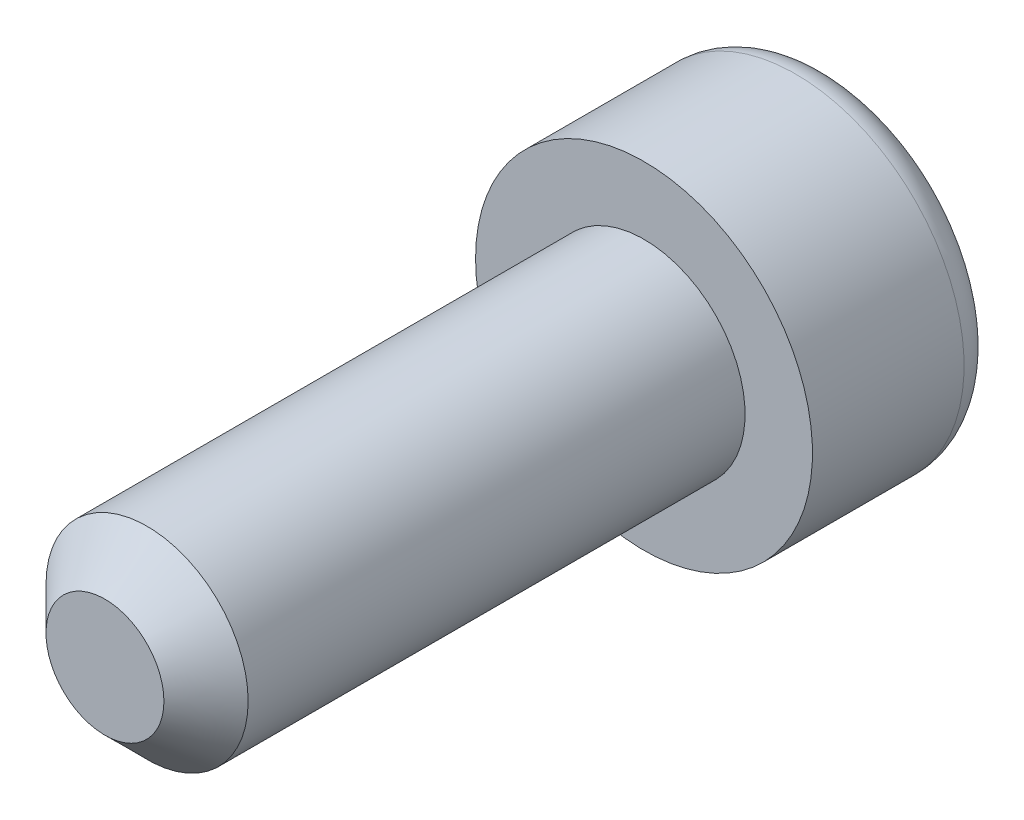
from build123d import *

# Parameters (mm, degrees)
ESQUISSE2_R             = 3
BASE_EXTRUSION_DEPTH    = 16
CHANFREIN2_SIZE         = 1.25
ESQUISSE8_R             = 5
BOSS_EXTRU_3_DEPTH      = 5.5
CONG_7_R                = 1
ENL_V_MAT_EXTRU_1_DEPTH = 4


with BuildPart() as part:
    # Esquisse2 → Base-Extrusion (new body)
    with BuildSketch(Plane.XY):
        with Locations(Location((0, 0, 0), (0, 0, 180))):
            Circle(ESQUISSE2_R)
    extrude(amount=BASE_EXTRUSION_DEPTH)

    # Chanfrein2
    chanfrein2_edges = [part.edges().sort_by_distance(p)[0] for p in [
        (3, 0, 16),
    ]]
    chamfer(chanfrein2_edges, length=CHANFREIN2_SIZE)

    # Esquisse8 → Boss.-Extru.3 (add)
    with BuildSketch(Plane(origin=(0, 0, 0), x_dir=(-1, 0, 0), z_dir=(0, 0, -1))):
        Circle(ESQUISSE8_R)
    extrude(amount=BOSS_EXTRU_3_DEPTH)

    # Cong_7
    cong_7_edges = [part.edges().sort_by_distance(p)[0] for p in [
        (5, 0, -5.5),
    ]]
    fillet(cong_7_edges, radius=CONG_7_R)

    # Esquisse10 → Enl_v. mat.-Extru.1 (cut)
    with BuildSketch(Plane(origin=(0, 0, -5.5), x_dir=(-1, 0, 0), z_dir=(0, 0, -1))):
        Polygon((0.711131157, -2.197185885), (2.258384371, -0.482735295), (1.547253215, 1.714450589), (-0.711131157, 2.197185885), (-2.258384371, 0.482735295), (-1.547253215, -1.714450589), align=None)
    extrude(amount=-ENL_V_MAT_EXTRU_1_DEPTH, mode=Mode.SUBTRACT)


solid = part.part
